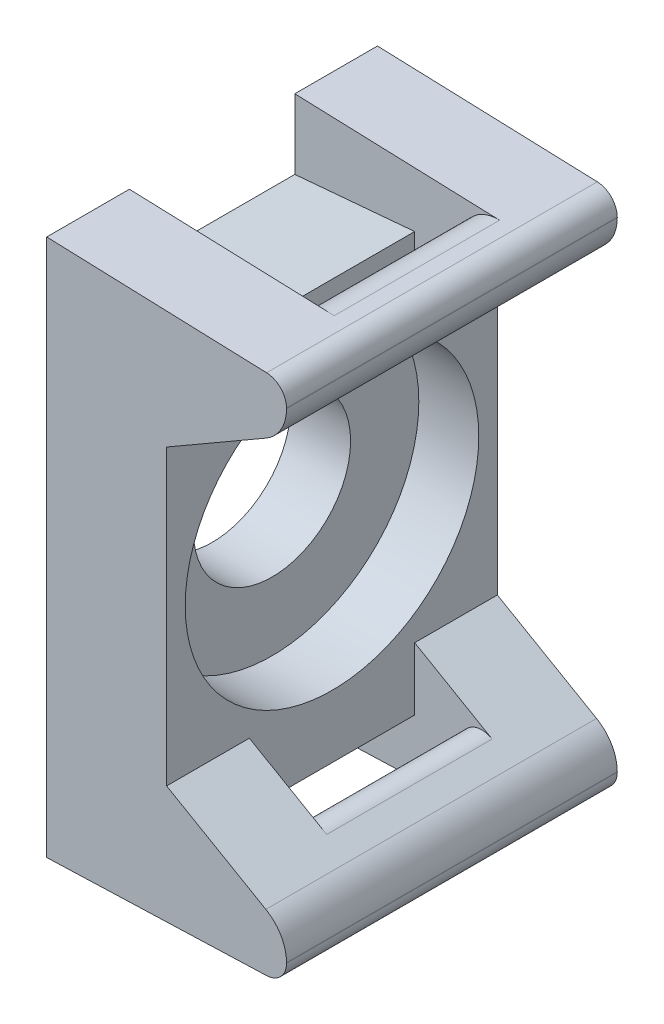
ISO-10303-21;
HEADER;
FILE_DESCRIPTION(('STEP AP214'),'2;1');
FILE_NAME('part.step','',(''),(''),'','','');
FILE_SCHEMA(('AUTOMOTIVE_DESIGN { 1 0 10303 214 1 1 1 1 }'));
ENDSEC;
DATA;
#1=APPLICATION_CONTEXT('core data for automotive mechanical design processes');
#2=APPLICATION_PROTOCOL_DEFINITION('international standard','automotive_design',2000,#1);
#3=PRODUCT_CONTEXT('',#1,'mechanical');
#4=PRODUCT('Part','Part','',(#3));
#5=PRODUCT_RELATED_PRODUCT_CATEGORY('part','',(#4));
#6=PRODUCT_DEFINITION_FORMATION('','',#4);
#7=PRODUCT_DEFINITION_CONTEXT('part definition',#1,'design');
#8=PRODUCT_DEFINITION('design','',#6,#7);
#9=PRODUCT_DEFINITION_SHAPE('','',#8);
#10=(LENGTH_UNIT() NAMED_UNIT(*) SI_UNIT(.MILLI.,.METRE.));
#11=(NAMED_UNIT(*) PLANE_ANGLE_UNIT() SI_UNIT($,.RADIAN.));
#12=(NAMED_UNIT(*) SI_UNIT($,.STERADIAN.) SOLID_ANGLE_UNIT());
#13=UNCERTAINTY_MEASURE_WITH_UNIT(LENGTH_MEASURE(1.E-05),#10,'distance_accuracy_value','');
#14=(GEOMETRIC_REPRESENTATION_CONTEXT(3) GLOBAL_UNCERTAINTY_ASSIGNED_CONTEXT((#13)) GLOBAL_UNIT_ASSIGNED_CONTEXT((#10,
#11,#12)) REPRESENTATION_CONTEXT('',''));
#15=CARTESIAN_POINT('',(0.,0.,0.));
#16=DIRECTION('',(0.,0.,1.));
#17=DIRECTION('',(1.,0.,0.));
#18=AXIS2_PLACEMENT_3D('',#15,#16,#17);
#19=CARTESIAN_POINT('',(4.02222222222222,5.42756362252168,2.));
#20=DIRECTION('',(1.,0.,0.));
#21=DIRECTION('',(0.,0.,-1.));
#22=AXIS2_PLACEMENT_3D('',#19,#20,#21);
#23=PLANE('',#22);
#24=DIRECTION('',(0.,0.,1.));
#25=VECTOR('',#24,1.);
#26=CARTESIAN_POINT('',(4.02222222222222,5.06394070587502,2.));
#27=LINE('',#26,#25);
#28=CARTESIAN_POINT('',(4.02222222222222,5.06394070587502,2.));
#29=VERTEX_POINT('',#28);
#30=CARTESIAN_POINT('',(4.02222222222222,5.06394070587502,-2.));
#31=VERTEX_POINT('',#30);
#32=EDGE_CURVE('E434',#29,#31,#27,.F.);
#33=ORIENTED_EDGE('',*,*,#32,.F.);
#34=DIRECTION('',(0.,1.,0.));
#35=VECTOR('',#34,1.);
#36=CARTESIAN_POINT('',(4.02222222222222,0.,2.));
#37=LINE('',#36,#35);
#38=CARTESIAN_POINT('',(4.02222222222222,5.42756362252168,2.));
#39=VERTEX_POINT('',#38);
#40=EDGE_CURVE('E349',#29,#39,#37,.T.);
#41=ORIENTED_EDGE('',*,*,#40,.T.);
#42=DIRECTION('',(0.,0.,1.));
#43=VECTOR('',#42,1.);
#44=CARTESIAN_POINT('',(4.02222222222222,5.42756362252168,2.));
#45=LINE('',#44,#43);
#46=CARTESIAN_POINT('',(4.02222222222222,5.42756362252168,-2.));
#47=VERTEX_POINT('',#46);
#48=EDGE_CURVE('E355',#47,#39,#45,.T.);
#49=ORIENTED_EDGE('',*,*,#48,.F.);
#50=DIRECTION('',(0.,1.,0.));
#51=VECTOR('',#50,1.);
#52=CARTESIAN_POINT('',(4.02222222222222,5.42756362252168,-2.));
#53=LINE('',#52,#51);
#54=EDGE_CURVE('E439',#31,#47,#53,.T.);
#55=ORIENTED_EDGE('',*,*,#54,.F.);
#56=EDGE_LOOP('',(#33,#41,#49,#55));
#57=FACE_BOUND('',#56,.T.);
#58=ADVANCED_FACE('F16',(#57),#23,.F.);
#59=CARTESIAN_POINT('',(5.8,5.80166604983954,4.));
#60=DIRECTION('',(-1.,0.,0.));
#61=DIRECTION('',(0.,0.,1.));
#62=AXIS2_PLACEMENT_3D('',#59,#60,#61);
#63=PLANE('',#62);
#64=DIRECTION('',(0.,1.,0.));
#65=VECTOR('',#64,1.);
#66=CARTESIAN_POINT('',(5.8,5.80166604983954,-4.));
#67=LINE('',#66,#65);
#68=CARTESIAN_POINT('',(5.8,5.81461514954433,-4.));
#69=VERTEX_POINT('',#68);
#70=CARTESIAN_POINT('',(5.8,5.80166604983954,-4.));
#71=VERTEX_POINT('',#70);
#72=EDGE_CURVE('E198',#69,#71,#67,.F.);
#73=ORIENTED_EDGE('',*,*,#72,.F.);
#74=DIRECTION('',(0.,0.,1.));
#75=VECTOR('',#74,1.);
#76=CARTESIAN_POINT('',(5.8,5.81461514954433,4.));
#77=LINE('',#76,#75);
#78=CARTESIAN_POINT('',(5.8,5.81461514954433,4.));
#79=VERTEX_POINT('',#78);
#80=EDGE_CURVE('E340',#79,#69,#77,.F.);
#81=ORIENTED_EDGE('',*,*,#80,.F.);
#82=DIRECTION('',(0.,1.,0.));
#83=VECTOR('',#82,1.);
#84=CARTESIAN_POINT('',(5.8,5.80166604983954,4.));
#85=LINE('',#84,#83);
#86=CARTESIAN_POINT('',(5.8,5.80166604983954,4.));
#87=VERTEX_POINT('',#86);
#88=EDGE_CURVE('E437',#87,#79,#85,.T.);
#89=ORIENTED_EDGE('',*,*,#88,.F.);
#90=DIRECTION('',(0.,0.,1.));
#91=VECTOR('',#90,1.);
#92=CARTESIAN_POINT('',(5.8,5.80166604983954,4.));
#93=LINE('',#92,#91);
#94=EDGE_CURVE('E459',#71,#87,#93,.T.);
#95=ORIENTED_EDGE('',*,*,#94,.F.);
#96=EDGE_LOOP('',(#73,#81,#89,#95));
#97=FACE_BOUND('',#96,.T.);
#98=ADVANCED_FACE('F645',(#97),#63,.F.);
#99=CARTESIAN_POINT('',(4.52222222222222,-5.06394070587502,2.));
#100=DIRECTION('',(0.,0.,1.));
#101=DIRECTION('',(1.,0.,0.));
#102=AXIS2_PLACEMENT_3D('',#99,#100,#101);
#103=CYLINDRICAL_SURFACE('',#102,0.5);
#104=CARTESIAN_POINT('',(4.52222222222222,-5.06394070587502,2.));
#105=DIRECTION('',(0.,0.,1.));
#106=DIRECTION('',(1.,0.,0.));
#107=AXIS2_PLACEMENT_3D('',#104,#105,#106);
#108=CIRCLE('',#107,0.5);
#109=CARTESIAN_POINT('',(4.02222222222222,-5.06394070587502,2.));
#110=VERTEX_POINT('',#109);
#111=CARTESIAN_POINT('',(4.77222222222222,-4.6309280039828,2.));
#112=VERTEX_POINT('',#111);
#113=EDGE_CURVE('E197',#110,#112,#108,.F.);
#114=ORIENTED_EDGE('',*,*,#113,.T.);
#115=DIRECTION('',(0.,0.,1.));
#116=VECTOR('',#115,1.);
#117=CARTESIAN_POINT('',(4.77222222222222,-4.6309280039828,4.));
#118=LINE('',#117,#116);
#119=CARTESIAN_POINT('',(4.77222222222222,-4.6309280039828,-2.));
#120=VERTEX_POINT('',#119);
#121=EDGE_CURVE('E200',#112,#120,#118,.F.);
#122=ORIENTED_EDGE('',*,*,#121,.T.);
#123=CARTESIAN_POINT('',(4.52222222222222,-5.06394070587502,-2.));
#124=DIRECTION('',(0.,0.,1.));
#125=DIRECTION('',(1.,0.,0.));
#126=AXIS2_PLACEMENT_3D('',#123,#124,#125);
#127=CIRCLE('',#126,0.5);
#128=CARTESIAN_POINT('',(4.02222222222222,-5.06394070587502,-2.));
#129=VERTEX_POINT('',#128);
#130=EDGE_CURVE('E19',#120,#129,#127,.T.);
#131=ORIENTED_EDGE('',*,*,#130,.T.);
#132=DIRECTION('',(0.,0.,-1.));
#133=VECTOR('',#132,1.);
#134=CARTESIAN_POINT('',(4.02222222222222,-5.06394070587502,2.));
#135=LINE('',#134,#133);
#136=EDGE_CURVE('E425',#129,#110,#135,.F.);
#137=ORIENTED_EDGE('',*,*,#136,.T.);
#138=EDGE_LOOP('',(#114,#122,#131,#137));
#139=FACE_BOUND('',#138,.T.);
#140=ADVANCED_FACE('F201',(#139),#103,.T.);
#141=CARTESIAN_POINT('',(4.8,-5.80166604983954,4.));
#142=DIRECTION('',(0.,0.,1.));
#143=DIRECTION('',(1.,0.,0.));
#144=AXIS2_PLACEMENT_3D('',#141,#142,#143);
#145=CYLINDRICAL_SURFACE('',#144,1.);
#146=DIRECTION('',(0.,0.,1.));
#147=VECTOR('',#146,1.);
#148=CARTESIAN_POINT('',(5.3,-4.9356406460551,4.));
#149=LINE('',#148,#147);
#150=CARTESIAN_POINT('',(5.3,-4.9356406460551,-4.));
#151=VERTEX_POINT('',#150);
#152=CARTESIAN_POINT('',(5.3,-4.9356406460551,4.));
#153=VERTEX_POINT('',#152);
#154=EDGE_CURVE('E205',#151,#153,#149,.T.);
#155=ORIENTED_EDGE('',*,*,#154,.T.);
#156=CARTESIAN_POINT('',(4.8,-5.80166604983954,4.));
#157=DIRECTION('',(0.,0.,1.));
#158=DIRECTION('',(1.,0.,0.));
#159=AXIS2_PLACEMENT_3D('',#156,#157,#158);
#160=CIRCLE('',#159,1.);
#161=CARTESIAN_POINT('',(5.8,-5.80166604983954,4.));
#162=VERTEX_POINT('',#161);
#163=EDGE_CURVE('E490',#153,#162,#160,.F.);
#164=ORIENTED_EDGE('',*,*,#163,.T.);
#165=DIRECTION('',(0.,0.,1.));
#166=VECTOR('',#165,1.);
#167=CARTESIAN_POINT('',(5.8,-5.80166604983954,4.));
#168=LINE('',#167,#166);
#169=CARTESIAN_POINT('',(5.8,-5.80166604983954,-4.));
#170=VERTEX_POINT('',#169);
#171=EDGE_CURVE('E430',#162,#170,#168,.F.);
#172=ORIENTED_EDGE('',*,*,#171,.T.);
#173=CARTESIAN_POINT('',(4.8,-5.80166604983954,-4.));
#174=DIRECTION('',(0.,0.,1.));
#175=DIRECTION('',(1.,0.,0.));
#176=AXIS2_PLACEMENT_3D('',#173,#174,#175);
#177=CIRCLE('',#176,1.);
#178=EDGE_CURVE('E492',#170,#151,#177,.T.);
#179=ORIENTED_EDGE('',*,*,#178,.T.);
#180=EDGE_LOOP('',(#155,#164,#172,#179));
#181=FACE_BOUND('',#180,.T.);
#182=ADVANCED_FACE('F495',(#181),#145,.T.);
#183=CARTESIAN_POINT('',(4.8,5.80166604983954,4.));
#184=DIRECTION('',(0.,0.,1.));
#185=DIRECTION('',(1.,0.,0.));
#186=AXIS2_PLACEMENT_3D('',#183,#184,#185);
#187=CYLINDRICAL_SURFACE('',#186,1.);
#188=ORIENTED_EDGE('',*,*,#94,.T.);
#189=CARTESIAN_POINT('',(4.8,5.80166604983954,4.));
#190=DIRECTION('',(0.,0.,1.));
#191=DIRECTION('',(1.,0.,0.));
#192=AXIS2_PLACEMENT_3D('',#189,#190,#191);
#193=CIRCLE('',#192,1.);
#194=CARTESIAN_POINT('',(5.3,4.9356406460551,4.));
#195=VERTEX_POINT('',#194);
#196=EDGE_CURVE('E450',#87,#195,#193,.F.);
#197=ORIENTED_EDGE('',*,*,#196,.T.);
#198=DIRECTION('',(0.,0.,1.));
#199=VECTOR('',#198,1.);
#200=CARTESIAN_POINT('',(5.3,4.9356406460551,4.));
#201=LINE('',#200,#199);
#202=CARTESIAN_POINT('',(5.3,4.9356406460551,-4.));
#203=VERTEX_POINT('',#202);
#204=EDGE_CURVE('E291',#195,#203,#201,.F.);
#205=ORIENTED_EDGE('',*,*,#204,.T.);
#206=CARTESIAN_POINT('',(4.8,5.80166604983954,-4.));
#207=DIRECTION('',(0.,0.,1.));
#208=DIRECTION('',(1.,0.,0.));
#209=AXIS2_PLACEMENT_3D('',#206,#207,#208);
#210=CIRCLE('',#209,1.);
#211=EDGE_CURVE('E462',#203,#71,#210,.T.);
#212=ORIENTED_EDGE('',*,*,#211,.T.);
#213=EDGE_LOOP('',(#188,#197,#205,#212));
#214=FACE_BOUND('',#213,.T.);
#215=ADVANCED_FACE('F637',(#214),#187,.T.);
#216=CARTESIAN_POINT('',(4.52222222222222,5.06394070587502,2.));
#217=DIRECTION('',(0.,0.,1.));
#218=DIRECTION('',(1.,0.,0.));
#219=AXIS2_PLACEMENT_3D('',#216,#217,#218);
#220=CYLINDRICAL_SURFACE('',#219,0.5);
#221=CARTESIAN_POINT('',(4.52222222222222,5.06394070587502,2.));
#222=DIRECTION('',(0.,0.,1.));
#223=DIRECTION('',(1.,0.,0.));
#224=AXIS2_PLACEMENT_3D('',#221,#222,#223);
#225=CIRCLE('',#224,0.5);
#226=CARTESIAN_POINT('',(4.77222222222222,4.6309280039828,2.));
#227=VERTEX_POINT('',#226);
#228=EDGE_CURVE('E353',#227,#29,#225,.F.);
#229=ORIENTED_EDGE('',*,*,#228,.T.);
#230=ORIENTED_EDGE('',*,*,#32,.T.);
#231=CARTESIAN_POINT('',(4.52222222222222,5.06394070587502,-2.));
#232=DIRECTION('',(0.,0.,1.));
#233=DIRECTION('',(1.,0.,0.));
#234=AXIS2_PLACEMENT_3D('',#231,#232,#233);
#235=CIRCLE('',#234,0.5);
#236=CARTESIAN_POINT('',(4.77222222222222,4.6309280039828,-2.));
#237=VERTEX_POINT('',#236);
#238=EDGE_CURVE('E480',#237,#31,#235,.F.);
#239=ORIENTED_EDGE('',*,*,#238,.F.);
#240=DIRECTION('',(0.,0.,1.));
#241=VECTOR('',#240,1.);
#242=CARTESIAN_POINT('',(4.77222222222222,4.6309280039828,4.));
#243=LINE('',#242,#241);
#244=EDGE_CURVE('E394',#237,#227,#243,.T.);
#245=ORIENTED_EDGE('',*,*,#244,.T.);
#246=EDGE_LOOP('',(#229,#230,#239,#245));
#247=FACE_BOUND('',#246,.T.);
#248=ADVANCED_FACE('F633',(#247),#220,.T.);
#249=CARTESIAN_POINT('',(5.8,-5.81461514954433,4.));
#250=DIRECTION('',(-1.,0.,0.));
#251=DIRECTION('',(0.,0.,1.));
#252=AXIS2_PLACEMENT_3D('',#249,#250,#251);
#253=PLANE('',#252);
#254=DIRECTION('',(0.,1.,0.));
#255=VECTOR('',#254,1.);
#256=CARTESIAN_POINT('',(5.8,-5.81461514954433,-4.));
#257=LINE('',#256,#255);
#258=CARTESIAN_POINT('',(5.8,-5.81461514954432,-4.));
#259=VERTEX_POINT('',#258);
#260=EDGE_CURVE('E428',#170,#259,#257,.F.);
#261=ORIENTED_EDGE('',*,*,#260,.F.);
#262=ORIENTED_EDGE('',*,*,#171,.F.);
#263=DIRECTION('',(0.,1.,0.));
#264=VECTOR('',#263,1.);
#265=CARTESIAN_POINT('',(5.8,-5.81461514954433,4.));
#266=LINE('',#265,#264);
#267=CARTESIAN_POINT('',(5.8,-5.81461514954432,4.));
#268=VERTEX_POINT('',#267);
#269=EDGE_CURVE('E431',#268,#162,#266,.T.);
#270=ORIENTED_EDGE('',*,*,#269,.F.);
#271=DIRECTION('',(0.,0.,1.));
#272=VECTOR('',#271,1.);
#273=CARTESIAN_POINT('',(5.8,-5.81461514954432,4.));
#274=LINE('',#273,#272);
#275=EDGE_CURVE('E317',#259,#268,#274,.T.);
#276=ORIENTED_EDGE('',*,*,#275,.F.);
#277=EDGE_LOOP('',(#261,#262,#270,#276));
#278=FACE_BOUND('',#277,.T.);
#279=ADVANCED_FACE('F629',(#278),#253,.F.);
#280=CARTESIAN_POINT('',(4.02222222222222,-5.06394070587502,2.));
#281=DIRECTION('',(1.,0.,0.));
#282=DIRECTION('',(0.,0.,-1.));
#283=AXIS2_PLACEMENT_3D('',#280,#281,#282);
#284=PLANE('',#283);
#285=DIRECTION('',(0.,0.,1.));
#286=VECTOR('',#285,1.);
#287=CARTESIAN_POINT('',(4.02222222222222,-5.42756362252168,2.));
#288=LINE('',#287,#286);
#289=CARTESIAN_POINT('',(4.02222222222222,-5.42756362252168,2.));
#290=VERTEX_POINT('',#289);
#291=CARTESIAN_POINT('',(4.02222222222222,-5.42756362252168,-2.));
#292=VERTEX_POINT('',#291);
#293=EDGE_CURVE('E217',#290,#292,#288,.F.);
#294=ORIENTED_EDGE('',*,*,#293,.F.);
#295=DIRECTION('',(0.,1.,0.));
#296=VECTOR('',#295,1.);
#297=CARTESIAN_POINT('',(4.02222222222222,-5.06394070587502,2.));
#298=LINE('',#297,#296);
#299=EDGE_CURVE('E423',#110,#290,#298,.F.);
#300=ORIENTED_EDGE('',*,*,#299,.F.);
#301=ORIENTED_EDGE('',*,*,#136,.F.);
#302=DIRECTION('',(0.,1.,0.));
#303=VECTOR('',#302,1.);
#304=CARTESIAN_POINT('',(4.02222222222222,-5.06394070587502,-2.));
#305=LINE('',#304,#303);
#306=EDGE_CURVE('E193',#292,#129,#305,.T.);
#307=ORIENTED_EDGE('',*,*,#306,.F.);
#308=EDGE_LOOP('',(#294,#300,#301,#307));
#309=FACE_BOUND('',#308,.T.);
#310=ADVANCED_FACE('F625',(#309),#284,.F.);
#311=CARTESIAN_POINT('',(2.9,0.,0.));
#312=DIRECTION('',(-1.,0.,0.));
#313=DIRECTION('',(0.,0.,1.));
#314=AXIS2_PLACEMENT_3D('',#311,#312,#313);
#315=CYLINDRICAL_SURFACE('',#314,3.55);
#316=CARTESIAN_POINT('',(1.45,0.,0.));
#317=DIRECTION('',(-1.,0.,0.));
#318=DIRECTION('',(0.,0.,1.));
#319=AXIS2_PLACEMENT_3D('',#316,#317,#318);
#320=CIRCLE('',#319,3.55);
#321=CARTESIAN_POINT('',(1.45,0.,3.55));
#322=VERTEX_POINT('',#321);
#323=EDGE_CURVE('E427',#322,#322,#320,.F.);
#324=ORIENTED_EDGE('',*,*,#323,.F.);
#325=EDGE_LOOP('',(#324));
#326=FACE_BOUND('',#325,.T.);
#327=CARTESIAN_POINT('',(2.9,0.,0.));
#328=DIRECTION('',(-1.,0.,0.));
#329=DIRECTION('',(0.,0.,1.));
#330=AXIS2_PLACEMENT_3D('',#327,#328,#329);
#331=CIRCLE('',#330,3.55);
#332=CARTESIAN_POINT('',(2.9,0.,3.55));
#333=VERTEX_POINT('',#332);
#334=EDGE_CURVE('E215',#333,#333,#331,.F.);
#335=ORIENTED_EDGE('',*,*,#334,.T.);
#336=EDGE_LOOP('',(#335));
#337=FACE_BOUND('',#336,.T.);
#338=ADVANCED_FACE('F621',(#326,#337),#315,.F.);
#339=CARTESIAN_POINT('',(1.45,1.9,0.));
#340=DIRECTION('',(1.,0.,0.));
#341=DIRECTION('',(0.,0.,-1.));
#342=AXIS2_PLACEMENT_3D('',#339,#340,#341);
#343=PLANE('',#342);
#344=CARTESIAN_POINT('',(1.45,0.,0.));
#345=DIRECTION('',(-1.,0.,0.));
#346=DIRECTION('',(0.,0.,1.));
#347=AXIS2_PLACEMENT_3D('',#344,#345,#346);
#348=CIRCLE('',#347,1.9);
#349=CARTESIAN_POINT('',(1.45,0.,1.9));
#350=VERTEX_POINT('',#349);
#351=EDGE_CURVE('E235',#350,#350,#348,.T.);
#352=ORIENTED_EDGE('',*,*,#351,.T.);
#353=EDGE_LOOP('',(#352));
#354=FACE_BOUND('',#353,.T.);
#355=ORIENTED_EDGE('',*,*,#323,.T.);
#356=EDGE_LOOP('',(#355));
#357=FACE_BOUND('',#356,.T.);
#358=ADVANCED_FACE('F617',(#354,#357),#343,.T.);
#359=CARTESIAN_POINT('',(0.,0.,2.));
#360=DIRECTION('',(0.,0.,1.));
#361=DIRECTION('',(1.,0.,0.));
#362=AXIS2_PLACEMENT_3D('',#359,#360,#361);
#363=PLANE('',#362);
#364=DIRECTION('',(-0.996194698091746,-0.0871557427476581,0.));
#365=VECTOR('',#364,1.);
#366=CARTESIAN_POINT('',(0.,4.81022358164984,2.));
#367=LINE('',#366,#365);
#368=CARTESIAN_POINT('',(0.,4.81022358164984,2.));
#369=VERTEX_POINT('',#368);
#370=CARTESIAN_POINT('',(2.9,5.06394070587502,2.));
#371=VERTEX_POINT('',#370);
#372=EDGE_CURVE('E403',#369,#371,#367,.F.);
#373=ORIENTED_EDGE('',*,*,#372,.F.);
#374=DIRECTION('',(0.,1.,0.));
#375=VECTOR('',#374,1.);
#376=CARTESIAN_POINT('',(0.,0.,2.));
#377=LINE('',#376,#375);
#378=CARTESIAN_POINT('',(0.,6.5,2.));
#379=VERTEX_POINT('',#378);
#380=EDGE_CURVE('E352',#379,#369,#377,.F.);
#381=ORIENTED_EDGE('',*,*,#380,.F.);
#382=DIRECTION('',(0.999390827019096,-0.0348994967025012,0.));
#383=VECTOR('',#382,1.);
#384=CARTESIAN_POINT('',(5.31744974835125,6.31431056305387,2.));
#385=LINE('',#384,#383);
#386=CARTESIAN_POINT('',(4.95363176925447,6.32701536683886,2.));
#387=VERTEX_POINT('',#386);
#388=EDGE_CURVE('E333',#379,#387,#385,.T.);
#389=ORIENTED_EDGE('',*,*,#388,.T.);
#390=CARTESIAN_POINT('',(4.92222222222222,5.42756362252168,2.));
#391=DIRECTION('',(0.,0.,1.));
#392=DIRECTION('',(1.,0.,0.));
#393=AXIS2_PLACEMENT_3D('',#390,#391,#392);
#394=CIRCLE('',#393,0.9);
#395=EDGE_CURVE('E447',#39,#387,#394,.F.);
#396=ORIENTED_EDGE('',*,*,#395,.F.);
#397=ORIENTED_EDGE('',*,*,#40,.F.);
#398=ORIENTED_EDGE('',*,*,#228,.F.);
#399=DIRECTION('',(-0.866025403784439,-0.5,0.));
#400=VECTOR('',#399,1.);
#401=CARTESIAN_POINT('',(2.9,3.55,2.));
#402=LINE('',#401,#400);
#403=CARTESIAN_POINT('',(2.9,3.55,2.));
#404=VERTEX_POINT('',#403);
#405=EDGE_CURVE('E320',#227,#404,#402,.T.);
#406=ORIENTED_EDGE('',*,*,#405,.T.);
#407=DIRECTION('',(0.,1.,0.));
#408=VECTOR('',#407,1.);
#409=CARTESIAN_POINT('',(2.9,-3.55,2.));
#410=LINE('',#409,#408);
#411=EDGE_CURVE('E305',#404,#371,#410,.T.);
#412=ORIENTED_EDGE('',*,*,#411,.T.);
#413=EDGE_LOOP('',(#373,#381,#389,#396,#397,#398,#406,#412));
#414=FACE_BOUND('',#413,.T.);
#415=ADVANCED_FACE('F613',(#414),#363,.F.);
#416=CARTESIAN_POINT('',(4.92222222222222,5.42756362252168,2.));
#417=DIRECTION('',(0.,0.,1.));
#418=DIRECTION('',(1.,0.,0.));
#419=AXIS2_PLACEMENT_3D('',#416,#417,#418);
#420=CYLINDRICAL_SURFACE('',#419,0.9);
#421=ORIENTED_EDGE('',*,*,#395,.T.);
#422=DIRECTION('',(0.,0.,1.));
#423=VECTOR('',#422,1.);
#424=CARTESIAN_POINT('',(4.95363176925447,6.32701536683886,4.));
#425=LINE('',#424,#423);
#426=CARTESIAN_POINT('',(4.95363176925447,6.32701536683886,-2.));
#427=VERTEX_POINT('',#426);
#428=EDGE_CURVE('E330',#387,#427,#425,.F.);
#429=ORIENTED_EDGE('',*,*,#428,.T.);
#430=CARTESIAN_POINT('',(4.92222222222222,5.42756362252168,-2.));
#431=DIRECTION('',(0.,0.,1.));
#432=DIRECTION('',(1.,0.,0.));
#433=AXIS2_PLACEMENT_3D('',#430,#431,#432);
#434=CIRCLE('',#433,0.9);
#435=EDGE_CURVE('E341',#47,#427,#434,.F.);
#436=ORIENTED_EDGE('',*,*,#435,.F.);
#437=ORIENTED_EDGE('',*,*,#48,.T.);
#438=EDGE_LOOP('',(#421,#429,#436,#437));
#439=FACE_BOUND('',#438,.T.);
#440=ADVANCED_FACE('F609',(#439),#420,.T.);
#441=CARTESIAN_POINT('',(0.,0.,-2.));
#442=DIRECTION('',(0.,0.,1.));
#443=DIRECTION('',(1.,0.,0.));
#444=AXIS2_PLACEMENT_3D('',#441,#442,#443);
#445=PLANE('',#444);
#446=DIRECTION('',(-0.996194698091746,-0.0871557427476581,0.));
#447=VECTOR('',#446,1.);
#448=CARTESIAN_POINT('',(0.,4.81022358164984,-2.));
#449=LINE('',#448,#447);
#450=CARTESIAN_POINT('',(2.9,5.06394070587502,-2.));
#451=VERTEX_POINT('',#450);
#452=CARTESIAN_POINT('',(0.,4.81022358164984,-2.));
#453=VERTEX_POINT('',#452);
#454=EDGE_CURVE('E406',#451,#453,#449,.T.);
#455=ORIENTED_EDGE('',*,*,#454,.F.);
#456=DIRECTION('',(0.,1.,0.));
#457=VECTOR('',#456,1.);
#458=CARTESIAN_POINT('',(2.9,-3.55,-2.));
#459=LINE('',#458,#457);
#460=CARTESIAN_POINT('',(2.9,3.55,-2.));
#461=VERTEX_POINT('',#460);
#462=EDGE_CURVE('E369',#451,#461,#459,.F.);
#463=ORIENTED_EDGE('',*,*,#462,.T.);
#464=DIRECTION('',(-0.866025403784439,-0.5,0.));
#465=VECTOR('',#464,1.);
#466=CARTESIAN_POINT('',(2.9,3.55,-2.));
#467=LINE('',#466,#465);
#468=EDGE_CURVE('E294',#461,#237,#467,.F.);
#469=ORIENTED_EDGE('',*,*,#468,.T.);
#470=ORIENTED_EDGE('',*,*,#238,.T.);
#471=ORIENTED_EDGE('',*,*,#54,.T.);
#472=ORIENTED_EDGE('',*,*,#435,.T.);
#473=DIRECTION('',(0.999390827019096,-0.0348994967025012,0.));
#474=VECTOR('',#473,1.);
#475=CARTESIAN_POINT('',(5.31744974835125,6.31431056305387,-2.));
#476=LINE('',#475,#474);
#477=CARTESIAN_POINT('',(0.,6.5,-2.));
#478=VERTEX_POINT('',#477);
#479=EDGE_CURVE('E323',#427,#478,#476,.F.);
#480=ORIENTED_EDGE('',*,*,#479,.T.);
#481=DIRECTION('',(0.,1.,0.));
#482=VECTOR('',#481,1.);
#483=CARTESIAN_POINT('',(0.,0.,-2.));
#484=LINE('',#483,#482);
#485=EDGE_CURVE('E338',#478,#453,#484,.F.);
#486=ORIENTED_EDGE('',*,*,#485,.T.);
#487=EDGE_LOOP('',(#455,#463,#469,#470,#471,#472,#480,#486));
#488=FACE_BOUND('',#487,.T.);
#489=ADVANCED_FACE('F605',(#488),#445,.T.);
#490=CARTESIAN_POINT('',(5.3,5.81461514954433,4.));
#491=DIRECTION('',(0.,0.,1.));
#492=DIRECTION('',(1.,0.,0.));
#493=AXIS2_PLACEMENT_3D('',#490,#491,#492);
#494=CYLINDRICAL_SURFACE('',#493,0.5);
#495=DIRECTION('',(0.,0.,1.));
#496=VECTOR('',#495,1.);
#497=CARTESIAN_POINT('',(5.31744974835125,6.31431056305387,4.));
#498=LINE('',#497,#496);
#499=CARTESIAN_POINT('',(5.31744974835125,6.31431056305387,-4.));
#500=VERTEX_POINT('',#499);
#501=CARTESIAN_POINT('',(5.31744974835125,6.31431056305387,4.));
#502=VERTEX_POINT('',#501);
#503=EDGE_CURVE('E281',#500,#502,#498,.T.);
#504=ORIENTED_EDGE('',*,*,#503,.T.);
#505=CARTESIAN_POINT('',(5.3,5.81461514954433,4.));
#506=DIRECTION('',(0.,0.,1.));
#507=DIRECTION('',(1.,0.,0.));
#508=AXIS2_PLACEMENT_3D('',#505,#506,#507);
#509=CIRCLE('',#508,0.5);
#510=EDGE_CURVE('E206',#502,#79,#509,.F.);
#511=ORIENTED_EDGE('',*,*,#510,.T.);
#512=ORIENTED_EDGE('',*,*,#80,.T.);
#513=CARTESIAN_POINT('',(5.3,5.81461514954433,-4.));
#514=DIRECTION('',(0.,0.,1.));
#515=DIRECTION('',(1.,0.,0.));
#516=AXIS2_PLACEMENT_3D('',#513,#514,#515);
#517=CIRCLE('',#516,0.5);
#518=EDGE_CURVE('E409',#69,#500,#517,.T.);
#519=ORIENTED_EDGE('',*,*,#518,.T.);
#520=EDGE_LOOP('',(#504,#511,#512,#519));
#521=FACE_BOUND('',#520,.T.);
#522=ADVANCED_FACE('F602',(#521),#494,.T.);
#523=CARTESIAN_POINT('',(5.3,-4.9356406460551,4.));
#524=DIRECTION('',(-0.5,-0.866025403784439,0.));
#525=DIRECTION('',(0.866025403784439,-0.5,0.));
#526=AXIS2_PLACEMENT_3D('',#523,#524,#525);
#527=PLANE('',#526);
#528=DIRECTION('',(-0.866025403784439,0.5,0.));
#529=VECTOR('',#528,1.);
#530=CARTESIAN_POINT('',(5.3,-4.9356406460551,-4.));
#531=LINE('',#530,#529);
#532=CARTESIAN_POINT('',(2.9,-3.55,-4.));
#533=VERTEX_POINT('',#532);
#534=EDGE_CURVE('E364',#151,#533,#531,.T.);
#535=ORIENTED_EDGE('',*,*,#534,.T.);
#536=DIRECTION('',(0.,0.,1.));
#537=VECTOR('',#536,1.);
#538=CARTESIAN_POINT('',(2.9,-3.55,4.));
#539=LINE('',#538,#537);
#540=CARTESIAN_POINT('',(2.9,-3.55,-2.));
#541=VERTEX_POINT('',#540);
#542=EDGE_CURVE('E211',#533,#541,#539,.T.);
#543=ORIENTED_EDGE('',*,*,#542,.T.);
#544=DIRECTION('',(-0.866025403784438,0.5,0.));
#545=VECTOR('',#544,1.);
#546=CARTESIAN_POINT('',(4.77222222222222,-4.6309280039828,-2.));
#547=LINE('',#546,#545);
#548=EDGE_CURVE('E190',#120,#541,#547,.T.);
#549=ORIENTED_EDGE('',*,*,#548,.F.);
#550=ORIENTED_EDGE('',*,*,#121,.F.);
#551=DIRECTION('',(-0.866025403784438,0.5,0.));
#552=VECTOR('',#551,1.);
#553=CARTESIAN_POINT('',(4.77222222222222,-4.6309280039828,2.));
#554=LINE('',#553,#552);
#555=CARTESIAN_POINT('',(2.9,-3.55,2.));
#556=VERTEX_POINT('',#555);
#557=EDGE_CURVE('E384',#112,#556,#554,.T.);
#558=ORIENTED_EDGE('',*,*,#557,.T.);
#559=DIRECTION('',(0.,0.,1.));
#560=VECTOR('',#559,1.);
#561=CARTESIAN_POINT('',(2.9,-3.55,4.));
#562=LINE('',#561,#560);
#563=CARTESIAN_POINT('',(2.9,-3.55,4.));
#564=VERTEX_POINT('',#563);
#565=EDGE_CURVE('E308',#556,#564,#562,.T.);
#566=ORIENTED_EDGE('',*,*,#565,.T.);
#567=DIRECTION('',(-0.866025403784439,0.5,0.));
#568=VECTOR('',#567,1.);
#569=CARTESIAN_POINT('',(5.3,-4.9356406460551,4.));
#570=LINE('',#569,#568);
#571=EDGE_CURVE('E299',#153,#564,#570,.T.);
#572=ORIENTED_EDGE('',*,*,#571,.F.);
#573=ORIENTED_EDGE('',*,*,#154,.F.);
#574=EDGE_LOOP('',(#535,#543,#549,#550,#558,#566,#572,#573));
#575=FACE_BOUND('',#574,.T.);
#576=ADVANCED_FACE('F210',(#575),#527,.F.);
#577=CARTESIAN_POINT('',(2.9,3.55,4.));
#578=DIRECTION('',(-0.5,0.866025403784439,0.));
#579=DIRECTION('',(-0.866025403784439,-0.5,0.));
#580=AXIS2_PLACEMENT_3D('',#577,#578,#579);
#581=PLANE('',#580);
#582=ORIENTED_EDGE('',*,*,#405,.F.);
#583=ORIENTED_EDGE('',*,*,#244,.F.);
#584=ORIENTED_EDGE('',*,*,#468,.F.);
#585=DIRECTION('',(0.,0.,1.));
#586=VECTOR('',#585,1.);
#587=CARTESIAN_POINT('',(2.9,3.55,4.));
#588=LINE('',#587,#586);
#589=CARTESIAN_POINT('',(2.9,3.55,-4.));
#590=VERTEX_POINT('',#589);
#591=EDGE_CURVE('E367',#461,#590,#588,.F.);
#592=ORIENTED_EDGE('',*,*,#591,.T.);
#593=DIRECTION('',(0.866025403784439,0.5,0.));
#594=VECTOR('',#593,1.);
#595=CARTESIAN_POINT('',(2.9,3.55,-4.));
#596=LINE('',#595,#594);
#597=EDGE_CURVE('E363',#590,#203,#596,.T.);
#598=ORIENTED_EDGE('',*,*,#597,.T.);
#599=ORIENTED_EDGE('',*,*,#204,.F.);
#600=DIRECTION('',(0.866025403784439,0.5,0.));
#601=VECTOR('',#600,1.);
#602=CARTESIAN_POINT('',(2.9,3.55,4.));
#603=LINE('',#602,#601);
#604=CARTESIAN_POINT('',(2.9,3.55,4.));
#605=VERTEX_POINT('',#604);
#606=EDGE_CURVE('E298',#605,#195,#603,.T.);
#607=ORIENTED_EDGE('',*,*,#606,.F.);
#608=DIRECTION('',(0.,0.,1.));
#609=VECTOR('',#608,1.);
#610=CARTESIAN_POINT('',(2.9,3.55,4.));
#611=LINE('',#610,#609);
#612=EDGE_CURVE('E302',#605,#404,#611,.F.);
#613=ORIENTED_EDGE('',*,*,#612,.T.);
#614=EDGE_LOOP('',(#582,#583,#584,#592,#598,#599,#607,#613));
#615=FACE_BOUND('',#614,.T.);
#616=ADVANCED_FACE('F596',(#615),#581,.F.);
#617=CARTESIAN_POINT('',(5.3,-5.81461514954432,4.));
#618=DIRECTION('',(0.,0.,1.));
#619=DIRECTION('',(1.,0.,0.));
#620=AXIS2_PLACEMENT_3D('',#617,#618,#619);
#621=CYLINDRICAL_SURFACE('',#620,0.5);
#622=ORIENTED_EDGE('',*,*,#275,.T.);
#623=CARTESIAN_POINT('',(5.3,-5.81461514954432,4.));
#624=DIRECTION('',(0.,0.,1.));
#625=DIRECTION('',(1.,0.,0.));
#626=AXIS2_PLACEMENT_3D('',#623,#624,#625);
#627=CIRCLE('',#626,0.5);
#628=CARTESIAN_POINT('',(5.31744974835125,-6.31431056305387,4.));
#629=VERTEX_POINT('',#628);
#630=EDGE_CURVE('E284',#629,#268,#627,.T.);
#631=ORIENTED_EDGE('',*,*,#630,.F.);
#632=DIRECTION('',(0.,0.,1.));
#633=VECTOR('',#632,1.);
#634=CARTESIAN_POINT('',(5.31744974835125,-6.31431056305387,4.));
#635=LINE('',#634,#633);
#636=CARTESIAN_POINT('',(5.31744974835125,-6.31431056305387,-4.));
#637=VERTEX_POINT('',#636);
#638=EDGE_CURVE('E258',#629,#637,#635,.F.);
#639=ORIENTED_EDGE('',*,*,#638,.T.);
#640=CARTESIAN_POINT('',(5.3,-5.81461514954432,-4.));
#641=DIRECTION('',(0.,0.,1.));
#642=DIRECTION('',(1.,0.,0.));
#643=AXIS2_PLACEMENT_3D('',#640,#641,#642);
#644=CIRCLE('',#643,0.5);
#645=EDGE_CURVE('E468',#637,#259,#644,.T.);
#646=ORIENTED_EDGE('',*,*,#645,.T.);
#647=EDGE_LOOP('',(#622,#631,#639,#646));
#648=FACE_BOUND('',#647,.T.);
#649=ADVANCED_FACE('F549',(#648),#621,.T.);
#650=CARTESIAN_POINT('',(4.92222222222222,-5.42756362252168,2.));
#651=DIRECTION('',(0.,0.,1.));
#652=DIRECTION('',(1.,0.,0.));
#653=AXIS2_PLACEMENT_3D('',#650,#651,#652);
#654=CYLINDRICAL_SURFACE('',#653,0.9);
#655=CARTESIAN_POINT('',(4.92222222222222,-5.42756362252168,2.));
#656=DIRECTION('',(0.,0.,1.));
#657=DIRECTION('',(1.,0.,0.));
#658=AXIS2_PLACEMENT_3D('',#655,#656,#657);
#659=CIRCLE('',#658,0.9);
#660=CARTESIAN_POINT('',(4.95363176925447,-6.32701536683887,2.));
#661=VERTEX_POINT('',#660);
#662=EDGE_CURVE('E311',#661,#290,#659,.F.);
#663=ORIENTED_EDGE('',*,*,#662,.T.);
#664=ORIENTED_EDGE('',*,*,#293,.T.);
#665=CARTESIAN_POINT('',(4.92222222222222,-5.42756362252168,-2.));
#666=DIRECTION('',(0.,0.,1.));
#667=DIRECTION('',(1.,0.,0.));
#668=AXIS2_PLACEMENT_3D('',#665,#666,#667);
#669=CIRCLE('',#668,0.9);
#670=CARTESIAN_POINT('',(4.95363176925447,-6.32701536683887,-2.));
#671=VERTEX_POINT('',#670);
#672=EDGE_CURVE('E213',#671,#292,#669,.F.);
#673=ORIENTED_EDGE('',*,*,#672,.F.);
#674=DIRECTION('',(0.,0.,1.));
#675=VECTOR('',#674,1.);
#676=CARTESIAN_POINT('',(4.95363176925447,-6.32701536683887,4.));
#677=LINE('',#676,#675);
#678=EDGE_CURVE('E225',#671,#661,#677,.T.);
#679=ORIENTED_EDGE('',*,*,#678,.T.);
#680=EDGE_LOOP('',(#663,#664,#673,#679));
#681=FACE_BOUND('',#680,.T.);
#682=ADVANCED_FACE('F559',(#681),#654,.T.);
#683=CARTESIAN_POINT('',(0.,0.,-2.));
#684=DIRECTION('',(0.,0.,1.));
#685=DIRECTION('',(1.,0.,0.));
#686=AXIS2_PLACEMENT_3D('',#683,#684,#685);
#687=PLANE('',#686);
#688=DIRECTION('',(0.996194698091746,-0.0871557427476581,0.));
#689=VECTOR('',#688,1.);
#690=CARTESIAN_POINT('',(2.9,-5.06394070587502,-2.));
#691=LINE('',#690,#689);
#692=CARTESIAN_POINT('',(0.,-4.81022358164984,-2.));
#693=VERTEX_POINT('',#692);
#694=CARTESIAN_POINT('',(2.9,-5.06394070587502,-2.));
#695=VERTEX_POINT('',#694);
#696=EDGE_CURVE('E231',#693,#695,#691,.T.);
#697=ORIENTED_EDGE('',*,*,#696,.F.);
#698=DIRECTION('',(0.,1.,0.));
#699=VECTOR('',#698,1.);
#700=CARTESIAN_POINT('',(0.,0.,-2.));
#701=LINE('',#700,#699);
#702=CARTESIAN_POINT('',(0.,-6.5,-2.));
#703=VERTEX_POINT('',#702);
#704=EDGE_CURVE('E212',#693,#703,#701,.F.);
#705=ORIENTED_EDGE('',*,*,#704,.T.);
#706=DIRECTION('',(-0.999390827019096,-0.0348994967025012,0.));
#707=VECTOR('',#706,1.);
#708=CARTESIAN_POINT('',(0.,-6.5,-2.));
#709=LINE('',#708,#707);
#710=EDGE_CURVE('E229',#703,#671,#709,.F.);
#711=ORIENTED_EDGE('',*,*,#710,.T.);
#712=ORIENTED_EDGE('',*,*,#672,.T.);
#713=ORIENTED_EDGE('',*,*,#306,.T.);
#714=ORIENTED_EDGE('',*,*,#130,.F.);
#715=ORIENTED_EDGE('',*,*,#548,.T.);
#716=DIRECTION('',(0.,1.,0.));
#717=VECTOR('',#716,1.);
#718=CARTESIAN_POINT('',(2.9,-3.55,-2.));
#719=LINE('',#718,#717);
#720=EDGE_CURVE('E312',#541,#695,#719,.F.);
#721=ORIENTED_EDGE('',*,*,#720,.T.);
#722=EDGE_LOOP('',(#697,#705,#711,#712,#713,#714,#715,#721));
#723=FACE_BOUND('',#722,.T.);
#724=ADVANCED_FACE('F187',(#723),#687,.T.);
#725=CARTESIAN_POINT('',(2.9,-3.55,4.));
#726=DIRECTION('',(-1.,0.,0.));
#727=DIRECTION('',(0.,0.,1.));
#728=AXIS2_PLACEMENT_3D('',#725,#726,#727);
#729=PLANE('',#728);
#730=DIRECTION('',(0.,1.,0.));
#731=VECTOR('',#730,1.);
#732=CARTESIAN_POINT('',(2.9,0.,2.));
#733=LINE('',#732,#731);
#734=CARTESIAN_POINT('',(2.9,-5.06394070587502,2.));
#735=VERTEX_POINT('',#734);
#736=EDGE_CURVE('E236',#556,#735,#733,.F.);
#737=ORIENTED_EDGE('',*,*,#736,.T.);
#738=DIRECTION('',(0.,0.,1.));
#739=VECTOR('',#738,1.);
#740=CARTESIAN_POINT('',(2.9,-5.06394070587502,2.));
#741=LINE('',#740,#739);
#742=EDGE_CURVE('E377',#695,#735,#741,.T.);
#743=ORIENTED_EDGE('',*,*,#742,.F.);
#744=ORIENTED_EDGE('',*,*,#720,.F.);
#745=ORIENTED_EDGE('',*,*,#542,.F.);
#746=DIRECTION('',(0.,1.,0.));
#747=VECTOR('',#746,1.);
#748=CARTESIAN_POINT('',(2.9,-5.81461514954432,-4.));
#749=LINE('',#748,#747);
#750=EDGE_CURVE('E360',#533,#590,#749,.T.);
#751=ORIENTED_EDGE('',*,*,#750,.T.);
#752=ORIENTED_EDGE('',*,*,#591,.F.);
#753=ORIENTED_EDGE('',*,*,#462,.F.);
#754=DIRECTION('',(0.,0.,1.));
#755=VECTOR('',#754,1.);
#756=CARTESIAN_POINT('',(2.9,5.06394070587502,2.));
#757=LINE('',#756,#755);
#758=EDGE_CURVE('E346',#371,#451,#757,.F.);
#759=ORIENTED_EDGE('',*,*,#758,.F.);
#760=ORIENTED_EDGE('',*,*,#411,.F.);
#761=ORIENTED_EDGE('',*,*,#612,.F.);
#762=DIRECTION('',(0.,1.,0.));
#763=VECTOR('',#762,1.);
#764=CARTESIAN_POINT('',(2.9,-5.81461514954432,4.));
#765=LINE('',#764,#763);
#766=EDGE_CURVE('E295',#564,#605,#765,.T.);
#767=ORIENTED_EDGE('',*,*,#766,.F.);
#768=ORIENTED_EDGE('',*,*,#565,.F.);
#769=EDGE_LOOP('',(#737,#743,#744,#745,#751,#752,#753,#759,#760,#761,#767,#768));
#770=FACE_BOUND('',#769,.T.);
#771=ORIENTED_EDGE('',*,*,#334,.F.);
#772=EDGE_LOOP('',(#771));
#773=FACE_BOUND('',#772,.T.);
#774=ADVANCED_FACE('F516',(#770,#773),#729,.F.);
#775=CARTESIAN_POINT('',(0.,0.,2.));
#776=DIRECTION('',(0.,0.,1.));
#777=DIRECTION('',(1.,0.,0.));
#778=AXIS2_PLACEMENT_3D('',#775,#776,#777);
#779=PLANE('',#778);
#780=DIRECTION('',(0.996194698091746,-0.0871557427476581,0.));
#781=VECTOR('',#780,1.);
#782=CARTESIAN_POINT('',(2.9,-5.06394070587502,2.));
#783=LINE('',#782,#781);
#784=CARTESIAN_POINT('',(0.,-4.81022358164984,2.));
#785=VERTEX_POINT('',#784);
#786=EDGE_CURVE('E375',#735,#785,#783,.F.);
#787=ORIENTED_EDGE('',*,*,#786,.F.);
#788=ORIENTED_EDGE('',*,*,#736,.F.);
#789=ORIENTED_EDGE('',*,*,#557,.F.);
#790=ORIENTED_EDGE('',*,*,#113,.F.);
#791=ORIENTED_EDGE('',*,*,#299,.T.);
#792=ORIENTED_EDGE('',*,*,#662,.F.);
#793=DIRECTION('',(-0.999390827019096,-0.0348994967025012,0.));
#794=VECTOR('',#793,1.);
#795=CARTESIAN_POINT('',(0.,-6.5,2.));
#796=LINE('',#795,#794);
#797=CARTESIAN_POINT('',(0.,-6.5,2.));
#798=VERTEX_POINT('',#797);
#799=EDGE_CURVE('E228',#661,#798,#796,.T.);
#800=ORIENTED_EDGE('',*,*,#799,.T.);
#801=DIRECTION('',(0.,1.,0.));
#802=VECTOR('',#801,1.);
#803=CARTESIAN_POINT('',(0.,0.,2.));
#804=LINE('',#803,#802);
#805=EDGE_CURVE('E34',#785,#798,#804,.F.);
#806=ORIENTED_EDGE('',*,*,#805,.F.);
#807=EDGE_LOOP('',(#787,#788,#789,#790,#791,#792,#800,#806));
#808=FACE_BOUND('',#807,.T.);
#809=ADVANCED_FACE('F512',(#808),#779,.F.);
#810=CARTESIAN_POINT('',(2.9,0.,0.));
#811=DIRECTION('',(-1.,0.,0.));
#812=DIRECTION('',(0.,0.,1.));
#813=AXIS2_PLACEMENT_3D('',#810,#811,#812);
#814=CYLINDRICAL_SURFACE('',#813,1.9);
#815=CARTESIAN_POINT('',(0.,0.,0.));
#816=DIRECTION('',(-1.,0.,0.));
#817=DIRECTION('',(0.,0.,1.));
#818=AXIS2_PLACEMENT_3D('',#815,#816,#817);
#819=CIRCLE('',#818,1.9);
#820=CARTESIAN_POINT('',(0.,0.,1.9));
#821=VERTEX_POINT('',#820);
#822=EDGE_CURVE('E255',#821,#821,#819,.T.);
#823=ORIENTED_EDGE('',*,*,#822,.T.);
#824=EDGE_LOOP('',(#823));
#825=FACE_BOUND('',#824,.T.);
#826=ORIENTED_EDGE('',*,*,#351,.F.);
#827=EDGE_LOOP('',(#826));
#828=FACE_BOUND('',#827,.T.);
#829=ADVANCED_FACE('F582',(#825,#828),#814,.F.);
#830=CARTESIAN_POINT('',(5.3,-5.81461514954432,-4.));
#831=DIRECTION('',(0.,0.,1.));
#832=DIRECTION('',(1.,0.,0.));
#833=AXIS2_PLACEMENT_3D('',#830,#831,#832);
#834=PLANE('',#833);
#835=DIRECTION('',(0.999390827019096,-0.0348994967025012,0.));
#836=VECTOR('',#835,1.);
#837=CARTESIAN_POINT('',(5.31744974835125,6.31431056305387,-4.));
#838=LINE('',#837,#836);
#839=CARTESIAN_POINT('',(0.,6.5,-4.));
#840=VERTEX_POINT('',#839);
#841=EDGE_CURVE('E285',#840,#500,#838,.T.);
#842=ORIENTED_EDGE('',*,*,#841,.T.);
#843=ORIENTED_EDGE('',*,*,#518,.F.);
#844=ORIENTED_EDGE('',*,*,#72,.T.);
#845=ORIENTED_EDGE('',*,*,#211,.F.);
#846=ORIENTED_EDGE('',*,*,#597,.F.);
#847=ORIENTED_EDGE('',*,*,#750,.F.);
#848=ORIENTED_EDGE('',*,*,#534,.F.);
#849=ORIENTED_EDGE('',*,*,#178,.F.);
#850=ORIENTED_EDGE('',*,*,#260,.T.);
#851=ORIENTED_EDGE('',*,*,#645,.F.);
#852=DIRECTION('',(-0.999390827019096,-0.0348994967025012,0.));
#853=VECTOR('',#852,1.);
#854=CARTESIAN_POINT('',(0.,-6.5,-4.));
#855=LINE('',#854,#853);
#856=CARTESIAN_POINT('',(0.,-6.5,-4.));
#857=VERTEX_POINT('',#856);
#858=EDGE_CURVE('E246',#637,#857,#855,.T.);
#859=ORIENTED_EDGE('',*,*,#858,.T.);
#860=DIRECTION('',(0.,1.,0.));
#861=VECTOR('',#860,1.);
#862=CARTESIAN_POINT('',(0.,6.5,-4.));
#863=LINE('',#862,#861);
#864=EDGE_CURVE('E254',#857,#840,#863,.T.);
#865=ORIENTED_EDGE('',*,*,#864,.T.);
#866=EDGE_LOOP('',(#842,#843,#844,#845,#846,#847,#848,#849,#850,#851,#859,#865));
#867=FACE_BOUND('',#866,.T.);
#868=ADVANCED_FACE('F502',(#867),#834,.F.);
#869=CARTESIAN_POINT('',(0.,4.81022358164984,2.));
#870=DIRECTION('',(-0.0871557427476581,0.996194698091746,0.));
#871=DIRECTION('',(-0.996194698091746,-0.0871557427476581,0.));
#872=AXIS2_PLACEMENT_3D('',#869,#870,#871);
#873=PLANE('',#872);
#874=ORIENTED_EDGE('',*,*,#372,.T.);
#875=ORIENTED_EDGE('',*,*,#758,.T.);
#876=ORIENTED_EDGE('',*,*,#454,.T.);
#877=DIRECTION('',(0.,0.,-1.));
#878=VECTOR('',#877,1.);
#879=CARTESIAN_POINT('',(0.,4.81022358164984,4.));
#880=LINE('',#879,#878);
#881=EDGE_CURVE('E288',#453,#369,#880,.F.);
#882=ORIENTED_EDGE('',*,*,#881,.T.);
#883=EDGE_LOOP('',(#874,#875,#876,#882));
#884=FACE_BOUND('',#883,.T.);
#885=ADVANCED_FACE('F576',(#884),#873,.T.);
#886=CARTESIAN_POINT('',(5.31744974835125,6.31431056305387,4.));
#887=DIRECTION('',(-0.0348994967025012,-0.999390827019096,0.));
#888=DIRECTION('',(0.999390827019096,-0.0348994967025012,0.));
#889=AXIS2_PLACEMENT_3D('',#886,#887,#888);
#890=PLANE('',#889);
#891=ORIENTED_EDGE('',*,*,#841,.F.);
#892=DIRECTION('',(0.,0.,-1.));
#893=VECTOR('',#892,1.);
#894=CARTESIAN_POINT('',(0.,6.5,4.));
#895=LINE('',#894,#893);
#896=EDGE_CURVE('E268',#840,#478,#895,.F.);
#897=ORIENTED_EDGE('',*,*,#896,.T.);
#898=ORIENTED_EDGE('',*,*,#479,.F.);
#899=ORIENTED_EDGE('',*,*,#428,.F.);
#900=ORIENTED_EDGE('',*,*,#388,.F.);
#901=DIRECTION('',(0.,0.,-1.));
#902=VECTOR('',#901,1.);
#903=CARTESIAN_POINT('',(0.,6.5,4.));
#904=LINE('',#903,#902);
#905=CARTESIAN_POINT('',(0.,6.5,4.));
#906=VERTEX_POINT('',#905);
#907=EDGE_CURVE('E278',#379,#906,#904,.F.);
#908=ORIENTED_EDGE('',*,*,#907,.T.);
#909=DIRECTION('',(-0.999390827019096,0.0348994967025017,0.));
#910=VECTOR('',#909,1.);
#911=CARTESIAN_POINT('',(5.31744974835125,6.31431056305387,4.));
#912=LINE('',#911,#910);
#913=EDGE_CURVE('E273',#502,#906,#912,.T.);
#914=ORIENTED_EDGE('',*,*,#913,.F.);
#915=ORIENTED_EDGE('',*,*,#503,.F.);
#916=EDGE_LOOP('',(#891,#897,#898,#899,#900,#908,#914,#915));
#917=FACE_BOUND('',#916,.T.);
#918=ADVANCED_FACE('F532',(#917),#890,.F.);
#919=CARTESIAN_POINT('',(5.3,-5.81461514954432,4.));
#920=DIRECTION('',(0.,0.,1.));
#921=DIRECTION('',(1.,0.,0.));
#922=AXIS2_PLACEMENT_3D('',#919,#920,#921);
#923=PLANE('',#922);
#924=ORIENTED_EDGE('',*,*,#510,.F.);
#925=ORIENTED_EDGE('',*,*,#913,.T.);
#926=DIRECTION('',(0.,1.,0.));
#927=VECTOR('',#926,1.);
#928=CARTESIAN_POINT('',(0.,6.5,4.));
#929=LINE('',#928,#927);
#930=CARTESIAN_POINT('',(0.,-6.5,4.));
#931=VERTEX_POINT('',#930);
#932=EDGE_CURVE('E241',#906,#931,#929,.F.);
#933=ORIENTED_EDGE('',*,*,#932,.T.);
#934=DIRECTION('',(-0.999390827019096,-0.0348994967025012,0.));
#935=VECTOR('',#934,1.);
#936=CARTESIAN_POINT('',(0.,-6.5,4.));
#937=LINE('',#936,#935);
#938=EDGE_CURVE('E261',#931,#629,#937,.F.);
#939=ORIENTED_EDGE('',*,*,#938,.T.);
#940=ORIENTED_EDGE('',*,*,#630,.T.);
#941=ORIENTED_EDGE('',*,*,#269,.T.);
#942=ORIENTED_EDGE('',*,*,#163,.F.);
#943=ORIENTED_EDGE('',*,*,#571,.T.);
#944=ORIENTED_EDGE('',*,*,#766,.T.);
#945=ORIENTED_EDGE('',*,*,#606,.T.);
#946=ORIENTED_EDGE('',*,*,#196,.F.);
#947=ORIENTED_EDGE('',*,*,#88,.T.);
#948=EDGE_LOOP('',(#924,#925,#933,#939,#940,#941,#942,#943,#944,#945,#946,#947));
#949=FACE_BOUND('',#948,.T.);
#950=ADVANCED_FACE('F552',(#949),#923,.T.);
#951=CARTESIAN_POINT('',(0.,-6.5,4.));
#952=DIRECTION('',(-0.0348994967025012,0.999390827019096,0.));
#953=DIRECTION('',(-0.999390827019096,-0.0348994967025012,0.));
#954=AXIS2_PLACEMENT_3D('',#951,#952,#953);
#955=PLANE('',#954);
#956=ORIENTED_EDGE('',*,*,#799,.F.);
#957=ORIENTED_EDGE('',*,*,#678,.F.);
#958=ORIENTED_EDGE('',*,*,#710,.F.);
#959=DIRECTION('',(0.,0.,-1.));
#960=VECTOR('',#959,1.);
#961=CARTESIAN_POINT('',(0.,-6.5,4.));
#962=LINE('',#961,#960);
#963=EDGE_CURVE('E251',#703,#857,#962,.T.);
#964=ORIENTED_EDGE('',*,*,#963,.T.);
#965=ORIENTED_EDGE('',*,*,#858,.F.);
#966=ORIENTED_EDGE('',*,*,#638,.F.);
#967=ORIENTED_EDGE('',*,*,#938,.F.);
#968=DIRECTION('',(0.,0.,-1.));
#969=VECTOR('',#968,1.);
#970=CARTESIAN_POINT('',(0.,-6.5,4.));
#971=LINE('',#970,#969);
#972=EDGE_CURVE('E25',#931,#798,#971,.T.);
#973=ORIENTED_EDGE('',*,*,#972,.T.);
#974=EDGE_LOOP('',(#956,#957,#958,#964,#965,#966,#967,#973));
#975=FACE_BOUND('',#974,.T.);
#976=ADVANCED_FACE('F546',(#975),#955,.F.);
#977=CARTESIAN_POINT('',(2.9,-5.06394070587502,2.));
#978=DIRECTION('',(-0.0871557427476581,-0.996194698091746,0.));
#979=DIRECTION('',(0.996194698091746,-0.0871557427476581,0.));
#980=AXIS2_PLACEMENT_3D('',#977,#978,#979);
#981=PLANE('',#980);
#982=ORIENTED_EDGE('',*,*,#786,.T.);
#983=DIRECTION('',(0.,0.,-1.));
#984=VECTOR('',#983,1.);
#985=CARTESIAN_POINT('',(0.,-4.81022358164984,4.));
#986=LINE('',#985,#984);
#987=EDGE_CURVE('E11',#785,#693,#986,.T.);
#988=ORIENTED_EDGE('',*,*,#987,.T.);
#989=ORIENTED_EDGE('',*,*,#696,.T.);
#990=ORIENTED_EDGE('',*,*,#742,.T.);
#991=EDGE_LOOP('',(#982,#988,#989,#990));
#992=FACE_BOUND('',#991,.T.);
#993=ADVANCED_FACE('F561',(#992),#981,.T.);
#994=CARTESIAN_POINT('',(0.,6.5,4.));
#995=DIRECTION('',(1.,0.,0.));
#996=DIRECTION('',(0.,0.,-1.));
#997=AXIS2_PLACEMENT_3D('',#994,#995,#996);
#998=PLANE('',#997);
#999=ORIENTED_EDGE('',*,*,#805,.T.);
#1000=ORIENTED_EDGE('',*,*,#972,.F.);
#1001=ORIENTED_EDGE('',*,*,#932,.F.);
#1002=ORIENTED_EDGE('',*,*,#907,.F.);
#1003=ORIENTED_EDGE('',*,*,#380,.T.);
#1004=ORIENTED_EDGE('',*,*,#881,.F.);
#1005=ORIENTED_EDGE('',*,*,#485,.F.);
#1006=ORIENTED_EDGE('',*,*,#896,.F.);
#1007=ORIENTED_EDGE('',*,*,#864,.F.);
#1008=ORIENTED_EDGE('',*,*,#963,.F.);
#1009=ORIENTED_EDGE('',*,*,#704,.F.);
#1010=ORIENTED_EDGE('',*,*,#987,.F.);
#1011=EDGE_LOOP('',(#999,#1000,#1001,#1002,#1003,#1004,#1005,#1006,#1007,#1008,#1009,#1010));
#1012=FACE_BOUND('',#1011,.T.);
#1013=ORIENTED_EDGE('',*,*,#822,.F.);
#1014=EDGE_LOOP('',(#1013));
#1015=FACE_BOUND('',#1014,.T.);
#1016=ADVANCED_FACE('F538',(#1012,#1015),#998,.F.);
#1017=CLOSED_SHELL('',(#58,#98,#140,#182,#215,#248,#279,#310,#338,#358,#415,#440,#489,#522,#576,
#616,#649,#682,#724,#774,#809,#829,#868,#885,#918,#950,#976,#993,#1016));
#1018=MANIFOLD_SOLID_BREP('B1',#1017);
#1019=ADVANCED_BREP_SHAPE_REPRESENTATION('',(#18,#1018),#14);
#1020=SHAPE_DEFINITION_REPRESENTATION(#9,#1019);
ENDSEC;
END-ISO-10303-21;
